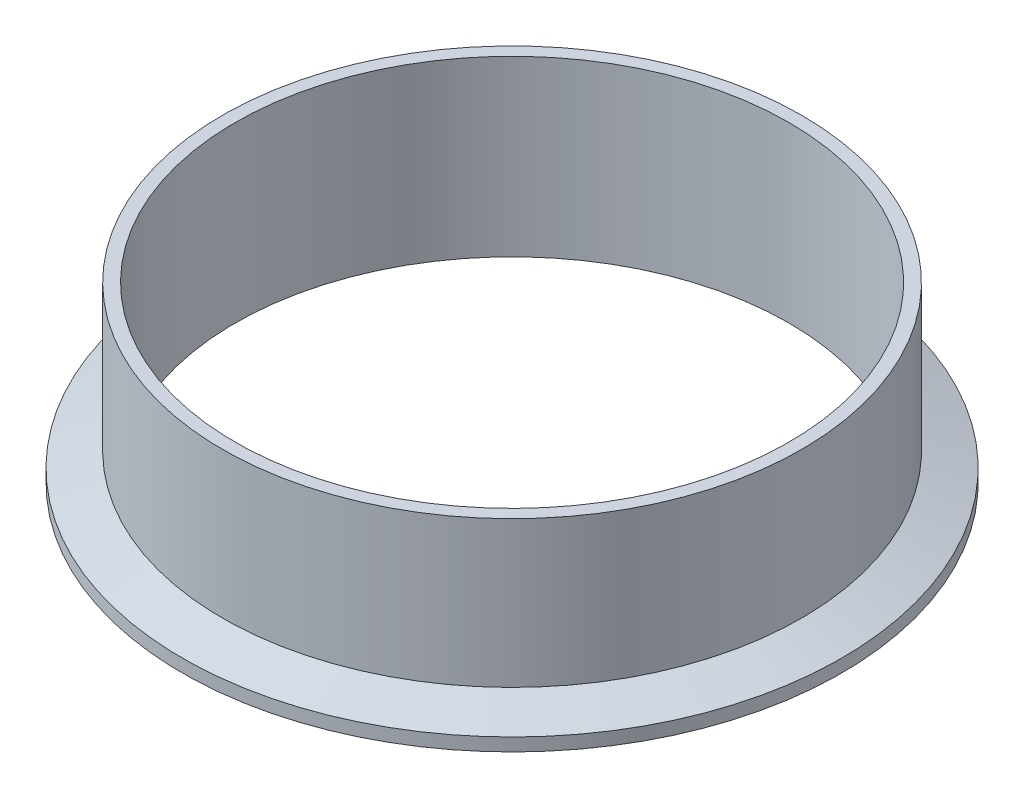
from build123d import *


with BuildPart() as part:
    # Sketch1 → Revolve2 (revolve)
    with BuildSketch(Plane.XY, mode=Mode.PRIVATE) as revolve2_sk:
        with BuildLine():
            Line((-60.7314, 0), (-60.7314, 38.1))
            Line((-60.7314, 38.1), (-63.5, 38.1))
            Line((-63.5, 38.1), (-63.5, 6.043516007))
            Line((-63.5, 6.043516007), (-72.2884, 2.8448))
            Line((-72.2884, 2.8448), (-72.2884, 0))
            Line((-72.2884, 0), (-69.280408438, 0))
            ThreePointArc((-69.280408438, 0), (-68.848211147, 0.129217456), (-68.557866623, 0.474458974))
            ThreePointArc((-68.557866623, 0.474458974), (-67.4624, 1.1938), (-66.366933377, 0.474458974))
            ThreePointArc((-66.366933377, 0.474458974), (-66.076588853, 0.129217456), (-65.644391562, 0))
            Line((-65.644391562, 0), (-60.7314, 0))
        make_face()
    revolve(revolve2_sk.sketch.rotate(Axis((0, 0, 0), (0, 1, 0)), 270), axis=Axis((0, 0, 0), (0, 1, 0)))


solid = part.part
